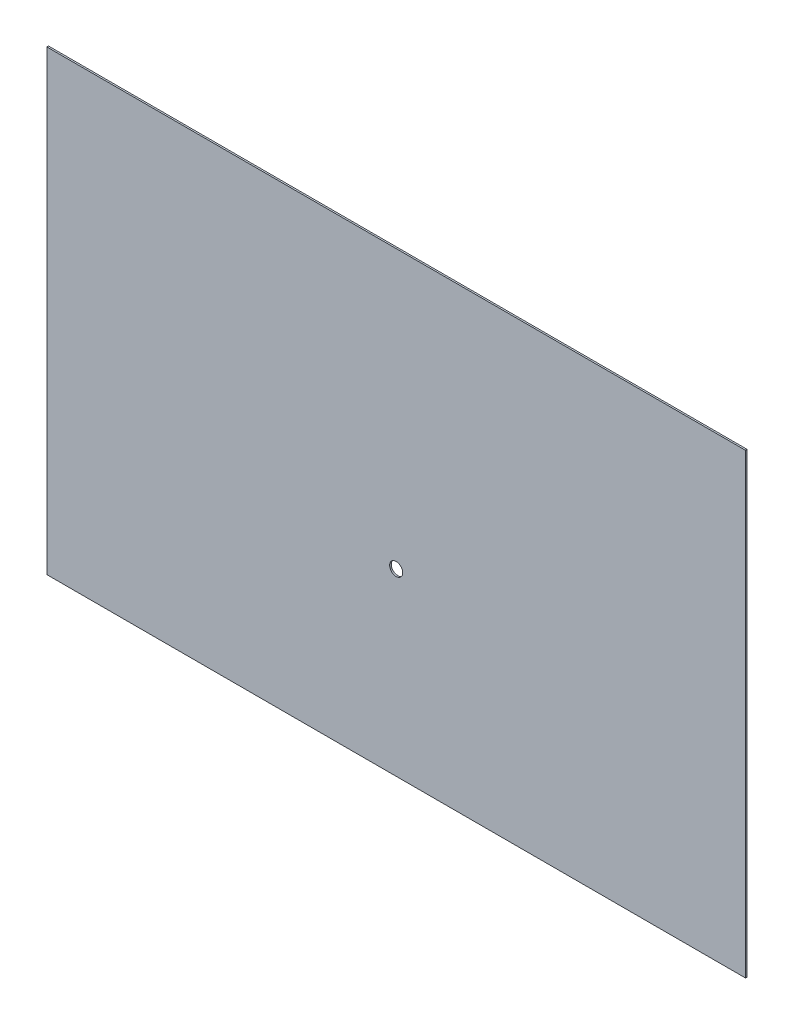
from build123d import *

# Parameters (mm, degrees)
ESQUISSE1_W        = 428
ESQUISSE1_H        = 280
ESQUISSE1_R        = 4
BOSS_EXTRU_1_DEPTH = 1


with BuildPart() as part:
    # Esquisse1 → Boss.-Extru.1 (new body)
    with BuildSketch(Plane.XY):
        with Locations((214, 140)):
            Rectangle(ESQUISSE1_W, ESQUISSE1_H)
        with Locations((214, 110)):
            Circle(ESQUISSE1_R, mode=Mode.SUBTRACT)
    extrude(amount=BOSS_EXTRU_1_DEPTH)


solid = part.part
